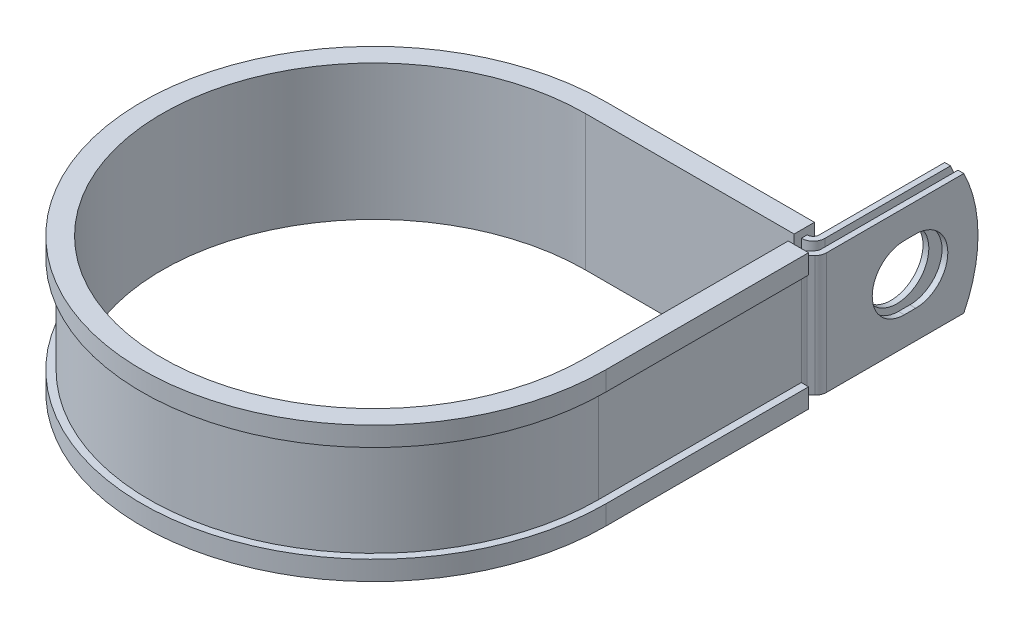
from build123d import *

# Parameters (mm, degrees)
EXTRUDE_THIN1_DEPTH = 12.7
SKETCH2_R           = 6.7437
CUT_EXTRUDE1_DEPTH  = 1.2192
CUT_EXTRUDE2_DEPTH  = 1.2192
CUT_EXTRUDE3_DEPTH  = 122.342844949


with BuildPart() as part:
    # Sketch1 → Extrude-Thin1 (new, symmetric)
    with BuildSketch(Plane(origin=(0, 0, 0), x_dir=(1, 0, 0), z_dir=(0, 1, 0))):
        with BuildLine():
            Line((47.8714698, 77.7748), (47.8714698, 45.974))
            ThreePointArc((47.8714698, 45.974), (47.778663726, 45.507432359), (47.514374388, 45.111895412))
            Line((47.514374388, 45.111895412), (46.688190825, 44.285711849))
            ThreePointArc((46.688190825, 44.285711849), (46.159612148, 43.494637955), (45.974, 42.561502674))
            Line((45.974, 42.561502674), (45.974, 0))
            ThreePointArc((45.974, 0), (-32.508527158, -32.508527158), (0, 45.974))
            Line((0, 45.974), (43.8582698, 45.974))
            ThreePointArc((43.8582698, 45.974), (45.582478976, 46.688190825), (46.2966698, 48.4124))
            Line((46.2966698, 48.4124), (46.2966698, 77.7748))
            Line((46.2966698, 77.7748), (45.0774698, 77.7748))
            Line((45.0774698, 77.7748), (45.0774698, 48.4124))
            ThreePointArc((45.0774698, 48.4124), (44.720374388, 47.550295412), (43.8582698, 47.1932))
            Line((43.8582698, 47.1932), (0, 47.1932))
            ThreePointArc((0, 47.1932), (-33.370631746, -33.370631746), (47.1932, 0))
            Line((47.1932, 0), (47.1932, 42.561502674))
            ThreePointArc((47.1932, 42.561502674), (47.286006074, 43.028070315), (47.550295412, 43.423607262))
            Line((47.550295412, 43.423607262), (48.376478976, 44.249790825))
            ThreePointArc((48.376478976, 44.249790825), (48.905057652, 45.040864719), (49.0906698, 45.974))
            Line((49.0906698, 45.974), (49.0906698, 77.7748))
            Line((49.0906698, 77.7748), (47.8714698, 77.7748))
        make_face()
    extrude(amount=EXTRUDE_THIN1_DEPTH, both=True)

    # Sketch2 → Cut-Extrude1 (cut)
    with BuildSketch(Plane.ZY.offset(-45.0774698)):
        with Locations((-63.5, 0)):
            Circle(SKETCH2_R)
    extrude(amount=-CUT_EXTRUDE1_DEPTH, mode=Mode.SUBTRACT)

    # Sketch3 → Cut-Extrude2 (cut)
    with BuildSketch(Plane(origin=(49.0906698, 0, 0), x_dir=(0, 0, -1), z_dir=(1, 0, 0))):
        with BuildLine():
            Line((62.3062, 6.7437), (64.6938, 6.7437))
            ThreePointArc((64.6938, 6.7437), (71.4375, 0), (64.6938, -6.7437))
            Line((64.6938, -6.7437), (62.3062, -6.7437))
            ThreePointArc((62.3062, -6.7437), (55.5625, 0), (62.3062, 6.7437))
        make_face()
    extrude(amount=-CUT_EXTRUDE2_DEPTH, mode=Mode.SUBTRACT)

    # Sketch4 → Cut-Extrude3 (cut, through all)
    with BuildSketch(Plane.ZY.offset(-45.0774698)):
        with BuildLine():
            Line((-74.797468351, 12.7), (-77.7748, 12.7))
            Line((-77.7748, 12.7), (-77.7748, 0))
            ThreePointArc((-77.7748, 0), (-77.020511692, 6.522164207), (-74.797468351, 12.7))
        make_face()
        with BuildLine():
            ThreePointArc((-74.797468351, -12.7), (-77.020511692, -6.522164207), (-77.7748, 0))
            Line((-77.7748, 0), (-77.7748, -12.7))
            Line((-77.7748, -12.7), (-74.797468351, -12.7))
        make_face()
    extrude(amount=-CUT_EXTRUDE3_DEPTH, mode=Mode.SUBTRACT)

    # Sweep1: sweep along a path in Sketch6
    with BuildLine(Plane(origin=(0, 12.7, 0), x_dir=(1, 0, 0), z_dir=(0, 1, 0))) as sweep1_path:
        Line((44.45, 42.561502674), (44.45, 0))
        ThreePointArc((44.45, 0), (-31.430896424, -31.430896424), (0, 44.45))
        Line((0, 44.45), (43.8074698, 44.45))
    # Sketch5 → Sweep1 (sweep)
    with BuildSketch(Plane(origin=(0, 0, -42.561502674), x_dir=(-1, 0, 0), z_dir=(0, 0, -1))):
        Polygon((-47.1932, 12.7), (-45.974, 12.7), (-45.974, -12.7), (-47.1932, -12.7), (-47.1932, -10.16), (-48.7172, -10.16), (-48.7172, -14.224), (-44.45, -14.224), (-44.45, 14.224), (-48.7172, 14.224), (-48.7172, 10.16), (-47.1932, 10.16), align=None)
    sweep(path=sweep1_path.line)


solid = part.part
